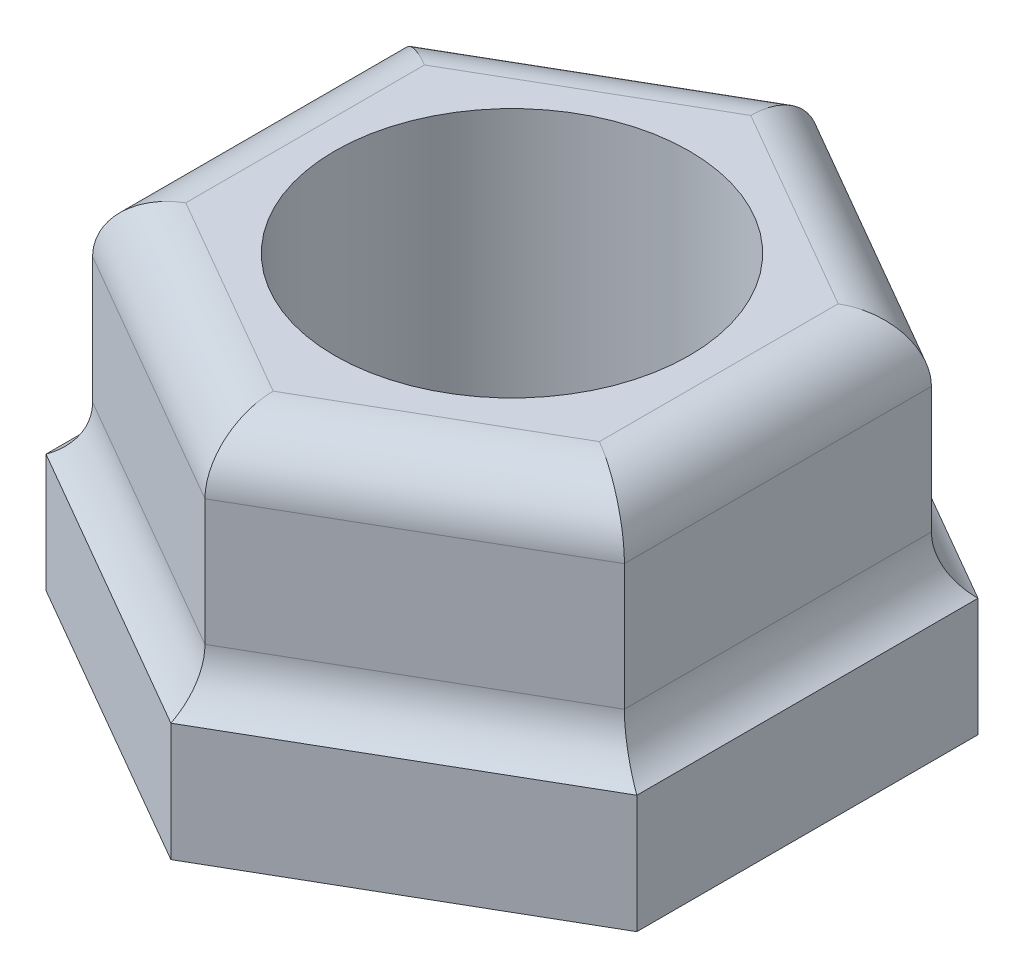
ISO-10303-21;
HEADER;
FILE_DESCRIPTION(('STEP AP214'),'2;1');
FILE_NAME('part.step','',(''),(''),'','','');
FILE_SCHEMA(('AUTOMOTIVE_DESIGN { 1 0 10303 214 1 1 1 1 }'));
ENDSEC;
DATA;
#1=APPLICATION_CONTEXT('core data for automotive mechanical design processes');
#2=APPLICATION_PROTOCOL_DEFINITION('international standard','automotive_design',2000,#1);
#3=PRODUCT_CONTEXT('',#1,'mechanical');
#4=PRODUCT('Part','Part','',(#3));
#5=PRODUCT_RELATED_PRODUCT_CATEGORY('part','',(#4));
#6=PRODUCT_DEFINITION_FORMATION('','',#4);
#7=PRODUCT_DEFINITION_CONTEXT('part definition',#1,'design');
#8=PRODUCT_DEFINITION('design','',#6,#7);
#9=PRODUCT_DEFINITION_SHAPE('','',#8);
#10=(LENGTH_UNIT() NAMED_UNIT(*) SI_UNIT(.MILLI.,.METRE.));
#11=(NAMED_UNIT(*) PLANE_ANGLE_UNIT() SI_UNIT($,.RADIAN.));
#12=(NAMED_UNIT(*) SI_UNIT($,.STERADIAN.) SOLID_ANGLE_UNIT());
#13=UNCERTAINTY_MEASURE_WITH_UNIT(LENGTH_MEASURE(1.E-05),#10,'distance_accuracy_value','');
#14=(GEOMETRIC_REPRESENTATION_CONTEXT(3) GLOBAL_UNCERTAINTY_ASSIGNED_CONTEXT((#13)) GLOBAL_UNIT_ASSIGNED_CONTEXT((#10,
#11,#12)) REPRESENTATION_CONTEXT('',''));
#15=CARTESIAN_POINT('',(0.,0.,0.));
#16=DIRECTION('',(0.,0.,1.));
#17=DIRECTION('',(1.,0.,0.));
#18=AXIS2_PLACEMENT_3D('',#15,#16,#17);
#19=CARTESIAN_POINT('',(0.,3.,0.));
#20=DIRECTION('',(0.,1.,0.));
#21=DIRECTION('',(0.,0.,1.));
#22=AXIS2_PLACEMENT_3D('',#19,#20,#21);
#23=PLANE('',#22);
#24=DIRECTION('',(0.,0.,-1.));
#25=VECTOR('',#24,1.);
#26=CARTESIAN_POINT('',(1.75,3.,0.));
#27=LINE('',#26,#25);
#28=CARTESIAN_POINT('',(1.75,3.,1.01036297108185));
#29=VERTEX_POINT('',#28);
#30=CARTESIAN_POINT('',(1.75,3.,-1.01036297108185));
#31=VERTEX_POINT('',#30);
#32=EDGE_CURVE('E243',#29,#31,#27,.T.);
#33=ORIENTED_EDGE('',*,*,#32,.T.);
#34=DIRECTION('',(-0.866025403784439,0.,-0.5));
#35=VECTOR('',#34,1.);
#36=CARTESIAN_POINT('',(0.875,3.,-1.51554445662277));
#37=LINE('',#36,#35);
#38=CARTESIAN_POINT('',(0.,3.,-2.02072594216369));
#39=VERTEX_POINT('',#38);
#40=EDGE_CURVE('E11',#31,#39,#37,.T.);
#41=ORIENTED_EDGE('',*,*,#40,.T.);
#42=DIRECTION('',(-0.866025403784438,0.,0.5));
#43=VECTOR('',#42,1.);
#44=CARTESIAN_POINT('',(-0.875000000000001,3.,-1.51554445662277));
#45=LINE('',#44,#43);
#46=CARTESIAN_POINT('',(-1.75,3.,-1.01036297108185));
#47=VERTEX_POINT('',#46);
#48=EDGE_CURVE('E57',#39,#47,#45,.T.);
#49=ORIENTED_EDGE('',*,*,#48,.T.);
#50=DIRECTION('',(0.,0.,1.));
#51=VECTOR('',#50,1.);
#52=CARTESIAN_POINT('',(-1.75,3.,0.));
#53=LINE('',#52,#51);
#54=CARTESIAN_POINT('',(-1.75,3.,1.01036297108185));
#55=VERTEX_POINT('',#54);
#56=EDGE_CURVE('E252',#47,#55,#53,.T.);
#57=ORIENTED_EDGE('',*,*,#56,.T.);
#58=DIRECTION('',(0.866025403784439,0.,0.5));
#59=VECTOR('',#58,1.);
#60=CARTESIAN_POINT('',(-0.875,3.,1.51554445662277));
#61=LINE('',#60,#59);
#62=CARTESIAN_POINT('',(0.,3.,2.02072594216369));
#63=VERTEX_POINT('',#62);
#64=EDGE_CURVE('E249',#55,#63,#61,.T.);
#65=ORIENTED_EDGE('',*,*,#64,.T.);
#66=DIRECTION('',(0.866025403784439,0.,-0.5));
#67=VECTOR('',#66,1.);
#68=CARTESIAN_POINT('',(0.875,3.,1.51554445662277));
#69=LINE('',#68,#67);
#70=EDGE_CURVE('E246',#63,#29,#69,.T.);
#71=ORIENTED_EDGE('',*,*,#70,.T.);
#72=EDGE_LOOP('',(#33,#41,#49,#57,#65,#71));
#73=FACE_BOUND('',#72,.T.);
#74=CARTESIAN_POINT('',(0.,3.,0.));
#75=DIRECTION('',(0.,1.,0.));
#76=DIRECTION('',(0.,0.,1.));
#77=AXIS2_PLACEMENT_3D('',#74,#75,#76);
#78=CIRCLE('',#77,1.5);
#79=CARTESIAN_POINT('',(0.,3.,1.5));
#80=VERTEX_POINT('',#79);
#81=EDGE_CURVE('E343',#80,#80,#78,.T.);
#82=ORIENTED_EDGE('',*,*,#81,.F.);
#83=EDGE_LOOP('',(#82));
#84=FACE_BOUND('',#83,.T.);
#85=ADVANCED_FACE('F47',(#73,#84),#23,.T.);
#86=CARTESIAN_POINT('',(-2.5,3.,1.44337567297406));
#87=DIRECTION('',(0.5,0.,-0.866025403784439));
#88=DIRECTION('',(-0.866025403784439,0.,-0.5));
#89=AXIS2_PLACEMENT_3D('',#86,#87,#88);
#90=PLANE('',#89);
#91=DIRECTION('',(0.866025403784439,0.,0.5));
#92=VECTOR('',#91,1.);
#93=CARTESIAN_POINT('',(-2.5,1.,1.44337567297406));
#94=LINE('',#93,#92);
#95=CARTESIAN_POINT('',(-2.5,1.,1.44337567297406));
#96=VERTEX_POINT('',#95);
#97=CARTESIAN_POINT('',(0.,1.,2.88675134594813));
#98=VERTEX_POINT('',#97);
#99=EDGE_CURVE('E157',#96,#98,#94,.T.);
#100=ORIENTED_EDGE('',*,*,#99,.F.);
#101=DIRECTION('',(0.,-1.,0.));
#102=VECTOR('',#101,1.);
#103=CARTESIAN_POINT('',(-2.5,3.,1.44337567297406));
#104=LINE('',#103,#102);
#105=CARTESIAN_POINT('',(-2.5,0.,1.44337567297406));
#106=VERTEX_POINT('',#105);
#107=EDGE_CURVE('E161',#96,#106,#104,.T.);
#108=ORIENTED_EDGE('',*,*,#107,.T.);
#109=DIRECTION('',(0.866025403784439,0.,0.5));
#110=VECTOR('',#109,1.);
#111=CARTESIAN_POINT('',(-2.5,0.,1.44337567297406));
#112=LINE('',#111,#110);
#113=CARTESIAN_POINT('',(0.,0.,2.88675134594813));
#114=VERTEX_POINT('',#113);
#115=EDGE_CURVE('E347',#106,#114,#112,.T.);
#116=ORIENTED_EDGE('',*,*,#115,.T.);
#117=DIRECTION('',(0.,-1.,0.));
#118=VECTOR('',#117,1.);
#119=CARTESIAN_POINT('',(0.,3.,2.88675134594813));
#120=LINE('',#119,#118);
#121=EDGE_CURVE('E163',#98,#114,#120,.T.);
#122=ORIENTED_EDGE('',*,*,#121,.F.);
#123=EDGE_LOOP('',(#100,#108,#116,#122));
#124=FACE_BOUND('',#123,.T.);
#125=ADVANCED_FACE('F159',(#124),#90,.F.);
#126=CARTESIAN_POINT('',(0.,3.,2.88675134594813));
#127=DIRECTION('',(-0.5,0.,-0.866025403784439));
#128=DIRECTION('',(-0.866025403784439,0.,0.5));
#129=AXIS2_PLACEMENT_3D('',#126,#127,#128);
#130=PLANE('',#129);
#131=DIRECTION('',(0.866025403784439,0.,-0.5));
#132=VECTOR('',#131,1.);
#133=CARTESIAN_POINT('',(0.,1.,2.88675134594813));
#134=LINE('',#133,#132);
#135=CARTESIAN_POINT('',(2.5,1.,1.44337567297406));
#136=VERTEX_POINT('',#135);
#137=EDGE_CURVE('E170',#98,#136,#134,.T.);
#138=ORIENTED_EDGE('',*,*,#137,.F.);
#139=ORIENTED_EDGE('',*,*,#121,.T.);
#140=DIRECTION('',(0.866025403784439,0.,-0.5));
#141=VECTOR('',#140,1.);
#142=CARTESIAN_POINT('',(0.,0.,2.88675134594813));
#143=LINE('',#142,#141);
#144=CARTESIAN_POINT('',(2.5,0.,1.44337567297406));
#145=VERTEX_POINT('',#144);
#146=EDGE_CURVE('E353',#114,#145,#143,.T.);
#147=ORIENTED_EDGE('',*,*,#146,.T.);
#148=DIRECTION('',(0.,-1.,0.));
#149=VECTOR('',#148,1.);
#150=CARTESIAN_POINT('',(2.5,3.,1.44337567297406));
#151=LINE('',#150,#149);
#152=EDGE_CURVE('E207',#136,#145,#151,.T.);
#153=ORIENTED_EDGE('',*,*,#152,.F.);
#154=EDGE_LOOP('',(#138,#139,#147,#153));
#155=FACE_BOUND('',#154,.T.);
#156=ADVANCED_FACE('F387',(#155),#130,.F.);
#157=CARTESIAN_POINT('',(2.5,3.,1.44337567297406));
#158=DIRECTION('',(-1.,0.,0.));
#159=DIRECTION('',(0.,0.,1.));
#160=AXIS2_PLACEMENT_3D('',#157,#158,#159);
#161=PLANE('',#160);
#162=DIRECTION('',(0.,0.,-1.));
#163=VECTOR('',#162,1.);
#164=CARTESIAN_POINT('',(2.5,1.,1.44337567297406));
#165=LINE('',#164,#163);
#166=CARTESIAN_POINT('',(2.5,1.,-1.44337567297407));
#167=VERTEX_POINT('',#166);
#168=EDGE_CURVE('E336',#136,#167,#165,.T.);
#169=ORIENTED_EDGE('',*,*,#168,.F.);
#170=ORIENTED_EDGE('',*,*,#152,.T.);
#171=DIRECTION('',(0.,0.,-1.));
#172=VECTOR('',#171,1.);
#173=CARTESIAN_POINT('',(2.5,0.,1.44337567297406));
#174=LINE('',#173,#172);
#175=CARTESIAN_POINT('',(2.5,0.,-1.44337567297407));
#176=VERTEX_POINT('',#175);
#177=EDGE_CURVE('E357',#145,#176,#174,.T.);
#178=ORIENTED_EDGE('',*,*,#177,.T.);
#179=DIRECTION('',(0.,-1.,0.));
#180=VECTOR('',#179,1.);
#181=CARTESIAN_POINT('',(2.5,3.,-1.44337567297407));
#182=LINE('',#181,#180);
#183=EDGE_CURVE('E376',#167,#176,#182,.T.);
#184=ORIENTED_EDGE('',*,*,#183,.F.);
#185=EDGE_LOOP('',(#169,#170,#178,#184));
#186=FACE_BOUND('',#185,.T.);
#187=ADVANCED_FACE('F381',(#186),#161,.F.);
#188=CARTESIAN_POINT('',(2.5,3.,-1.44337567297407));
#189=DIRECTION('',(-0.5,0.,0.866025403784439));
#190=DIRECTION('',(0.866025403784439,0.,0.5));
#191=AXIS2_PLACEMENT_3D('',#188,#189,#190);
#192=PLANE('',#191);
#193=DIRECTION('',(-0.866025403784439,0.,-0.5));
#194=VECTOR('',#193,1.);
#195=CARTESIAN_POINT('',(2.5,1.,-1.44337567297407));
#196=LINE('',#195,#194);
#197=CARTESIAN_POINT('',(0.,1.,-2.88675134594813));
#198=VERTEX_POINT('',#197);
#199=EDGE_CURVE('E332',#167,#198,#196,.T.);
#200=ORIENTED_EDGE('',*,*,#199,.F.);
#201=ORIENTED_EDGE('',*,*,#183,.T.);
#202=DIRECTION('',(-0.866025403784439,0.,-0.5));
#203=VECTOR('',#202,1.);
#204=CARTESIAN_POINT('',(2.5,0.,-1.44337567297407));
#205=LINE('',#204,#203);
#206=CARTESIAN_POINT('',(0.,0.,-2.88675134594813));
#207=VERTEX_POINT('',#206);
#208=EDGE_CURVE('E361',#176,#207,#205,.T.);
#209=ORIENTED_EDGE('',*,*,#208,.T.);
#210=DIRECTION('',(0.,-1.,0.));
#211=VECTOR('',#210,1.);
#212=CARTESIAN_POINT('',(0.,3.,-2.88675134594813));
#213=LINE('',#212,#211);
#214=EDGE_CURVE('E373',#198,#207,#213,.T.);
#215=ORIENTED_EDGE('',*,*,#214,.F.);
#216=EDGE_LOOP('',(#200,#201,#209,#215));
#217=FACE_BOUND('',#216,.T.);
#218=ADVANCED_FACE('F395',(#217),#192,.F.);
#219=CARTESIAN_POINT('',(0.,3.,-2.88675134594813));
#220=DIRECTION('',(0.5,0.,0.866025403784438));
#221=DIRECTION('',(0.866025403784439,0.,-0.5));
#222=AXIS2_PLACEMENT_3D('',#219,#220,#221);
#223=PLANE('',#222);
#224=DIRECTION('',(-0.866025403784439,0.,0.5));
#225=VECTOR('',#224,1.);
#226=CARTESIAN_POINT('',(0.,1.,-2.88675134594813));
#227=LINE('',#226,#225);
#228=CARTESIAN_POINT('',(-2.5,1.,-1.44337567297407));
#229=VERTEX_POINT('',#228);
#230=EDGE_CURVE('E329',#198,#229,#227,.T.);
#231=ORIENTED_EDGE('',*,*,#230,.F.);
#232=ORIENTED_EDGE('',*,*,#214,.T.);
#233=DIRECTION('',(-0.866025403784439,0.,0.5));
#234=VECTOR('',#233,1.);
#235=CARTESIAN_POINT('',(0.,0.,-2.88675134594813));
#236=LINE('',#235,#234);
#237=CARTESIAN_POINT('',(-2.5,0.,-1.44337567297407));
#238=VERTEX_POINT('',#237);
#239=EDGE_CURVE('E365',#207,#238,#236,.T.);
#240=ORIENTED_EDGE('',*,*,#239,.T.);
#241=DIRECTION('',(0.,-1.,0.));
#242=VECTOR('',#241,1.);
#243=CARTESIAN_POINT('',(-2.5,3.,-1.44337567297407));
#244=LINE('',#243,#242);
#245=EDGE_CURVE('E181',#229,#238,#244,.T.);
#246=ORIENTED_EDGE('',*,*,#245,.F.);
#247=EDGE_LOOP('',(#231,#232,#240,#246));
#248=FACE_BOUND('',#247,.T.);
#249=ADVANCED_FACE('F457',(#248),#223,.F.);
#250=CARTESIAN_POINT('',(-2.5,3.,-1.44337567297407));
#251=DIRECTION('',(1.,0.,0.));
#252=DIRECTION('',(0.,0.,-1.));
#253=AXIS2_PLACEMENT_3D('',#250,#251,#252);
#254=PLANE('',#253);
#255=DIRECTION('',(0.,0.,1.));
#256=VECTOR('',#255,1.);
#257=CARTESIAN_POINT('',(-2.5,1.,-1.44337567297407));
#258=LINE('',#257,#256);
#259=EDGE_CURVE('E175',#229,#96,#258,.T.);
#260=ORIENTED_EDGE('',*,*,#259,.F.);
#261=ORIENTED_EDGE('',*,*,#245,.T.);
#262=DIRECTION('',(0.,0.,1.));
#263=VECTOR('',#262,1.);
#264=CARTESIAN_POINT('',(-2.5,0.,-1.44337567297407));
#265=LINE('',#264,#263);
#266=EDGE_CURVE('E178',#238,#106,#265,.T.);
#267=ORIENTED_EDGE('',*,*,#266,.T.);
#268=ORIENTED_EDGE('',*,*,#107,.F.);
#269=EDGE_LOOP('',(#260,#261,#267,#268));
#270=FACE_BOUND('',#269,.T.);
#271=ADVANCED_FACE('F173',(#270),#254,.F.);
#272=CARTESIAN_POINT('',(0.,0.,0.));
#273=DIRECTION('',(0.,1.,0.));
#274=DIRECTION('',(0.,0.,1.));
#275=AXIS2_PLACEMENT_3D('',#272,#273,#274);
#276=PLANE('',#275);
#277=ORIENTED_EDGE('',*,*,#115,.F.);
#278=ORIENTED_EDGE('',*,*,#266,.F.);
#279=ORIENTED_EDGE('',*,*,#239,.F.);
#280=ORIENTED_EDGE('',*,*,#208,.F.);
#281=ORIENTED_EDGE('',*,*,#177,.F.);
#282=ORIENTED_EDGE('',*,*,#146,.F.);
#283=EDGE_LOOP('',(#277,#278,#279,#280,#281,#282));
#284=FACE_BOUND('',#283,.T.);
#285=CARTESIAN_POINT('',(0.,0.,0.));
#286=DIRECTION('',(0.,1.,0.));
#287=DIRECTION('',(0.,0.,1.));
#288=AXIS2_PLACEMENT_3D('',#285,#286,#287);
#289=CIRCLE('',#288,1.5);
#290=CARTESIAN_POINT('',(0.,0.,1.5));
#291=VERTEX_POINT('',#290);
#292=EDGE_CURVE('E169',#291,#291,#289,.T.);
#293=ORIENTED_EDGE('',*,*,#292,.T.);
#294=EDGE_LOOP('',(#293));
#295=FACE_BOUND('',#294,.T.);
#296=ADVANCED_FACE('F389',(#284,#295),#276,.F.);
#297=CARTESIAN_POINT('',(0.,3.,0.));
#298=DIRECTION('',(0.,-1.,0.));
#299=DIRECTION('',(0.,0.,-1.));
#300=AXIS2_PLACEMENT_3D('',#297,#298,#299);
#301=CYLINDRICAL_SURFACE('',#300,1.5);
#302=ORIENTED_EDGE('',*,*,#81,.T.);
#303=EDGE_LOOP('',(#302));
#304=FACE_BOUND('',#303,.T.);
#305=ORIENTED_EDGE('',*,*,#292,.F.);
#306=EDGE_LOOP('',(#305));
#307=FACE_BOUND('',#306,.T.);
#308=ADVANCED_FACE('F442',(#304,#307),#301,.F.);
#309=CARTESIAN_POINT('',(2.25,1.,1.29903810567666));
#310=DIRECTION('',(1.,0.,0.));
#311=DIRECTION('',(0.,0.,-1.));
#312=AXIS2_PLACEMENT_3D('',#309,#310,#311);
#313=PLANE('',#312);
#314=DIRECTION('',(0.,1.,0.));
#315=VECTOR('',#314,1.);
#316=CARTESIAN_POINT('',(2.25,1.,1.29903810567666));
#317=LINE('',#316,#315);
#318=CARTESIAN_POINT('',(2.25,1.43301270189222,1.29903810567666));
#319=VERTEX_POINT('',#318);
#320=CARTESIAN_POINT('',(2.25,2.5,1.29903810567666));
#321=VERTEX_POINT('',#320);
#322=EDGE_CURVE('E317',#319,#321,#317,.T.);
#323=ORIENTED_EDGE('',*,*,#322,.F.);
#324=DIRECTION('',(0.,0.,-1.));
#325=VECTOR('',#324,1.);
#326=CARTESIAN_POINT('',(2.25,1.43301270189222,-1.29903810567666));
#327=LINE('',#326,#325);
#328=CARTESIAN_POINT('',(2.25,1.43301270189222,-1.29903810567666));
#329=VERTEX_POINT('',#328);
#330=EDGE_CURVE('E240',#319,#329,#327,.T.);
#331=ORIENTED_EDGE('',*,*,#330,.T.);
#332=DIRECTION('',(0.,1.,0.));
#333=VECTOR('',#332,1.);
#334=CARTESIAN_POINT('',(2.25,1.,-1.29903810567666));
#335=LINE('',#334,#333);
#336=CARTESIAN_POINT('',(2.25,2.5,-1.29903810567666));
#337=VERTEX_POINT('',#336);
#338=EDGE_CURVE('E270',#329,#337,#335,.T.);
#339=ORIENTED_EDGE('',*,*,#338,.T.);
#340=DIRECTION('',(0.,0.,-1.));
#341=VECTOR('',#340,1.);
#342=CARTESIAN_POINT('',(2.25,2.5,1.29903810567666));
#343=LINE('',#342,#341);
#344=EDGE_CURVE('E237',#337,#321,#343,.F.);
#345=ORIENTED_EDGE('',*,*,#344,.T.);
#346=EDGE_LOOP('',(#323,#331,#339,#345));
#347=FACE_BOUND('',#346,.T.);
#348=ADVANCED_FACE('F424',(#347),#313,.T.);
#349=CARTESIAN_POINT('',(0.,1.,2.59807621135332));
#350=DIRECTION('',(0.5,0.,0.866025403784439));
#351=DIRECTION('',(0.866025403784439,0.,-0.5));
#352=AXIS2_PLACEMENT_3D('',#349,#350,#351);
#353=PLANE('',#352);
#354=DIRECTION('',(0.,1.,0.));
#355=VECTOR('',#354,1.);
#356=CARTESIAN_POINT('',(0.,1.,2.59807621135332));
#357=LINE('',#356,#355);
#358=CARTESIAN_POINT('',(0.,1.43301270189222,2.59807621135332));
#359=VERTEX_POINT('',#358);
#360=CARTESIAN_POINT('',(0.,2.5,2.59807621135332));
#361=VERTEX_POINT('',#360);
#362=EDGE_CURVE('E307',#359,#361,#357,.T.);
#363=ORIENTED_EDGE('',*,*,#362,.F.);
#364=DIRECTION('',(0.866025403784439,0.,-0.5));
#365=VECTOR('',#364,1.);
#366=CARTESIAN_POINT('',(2.25,1.43301270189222,1.29903810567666));
#367=LINE('',#366,#365);
#368=EDGE_CURVE('E234',#359,#319,#367,.T.);
#369=ORIENTED_EDGE('',*,*,#368,.T.);
#370=ORIENTED_EDGE('',*,*,#322,.T.);
#371=DIRECTION('',(0.866025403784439,0.,-0.5));
#372=VECTOR('',#371,1.);
#373=CARTESIAN_POINT('',(0.,2.5,2.59807621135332));
#374=LINE('',#373,#372);
#375=EDGE_CURVE('E231',#321,#361,#374,.F.);
#376=ORIENTED_EDGE('',*,*,#375,.T.);
#377=EDGE_LOOP('',(#363,#369,#370,#376));
#378=FACE_BOUND('',#377,.T.);
#379=ADVANCED_FACE('F433',(#378),#353,.T.);
#380=CARTESIAN_POINT('',(-2.25,1.,1.29903810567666));
#381=DIRECTION('',(-0.5,0.,0.866025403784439));
#382=DIRECTION('',(0.866025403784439,0.,0.5));
#383=AXIS2_PLACEMENT_3D('',#380,#381,#382);
#384=PLANE('',#383);
#385=DIRECTION('',(0.,1.,0.));
#386=VECTOR('',#385,1.);
#387=CARTESIAN_POINT('',(-2.25,1.,1.29903810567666));
#388=LINE('',#387,#386);
#389=CARTESIAN_POINT('',(-2.25,1.43301270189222,1.29903810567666));
#390=VERTEX_POINT('',#389);
#391=CARTESIAN_POINT('',(-2.25,2.5,1.29903810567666));
#392=VERTEX_POINT('',#391);
#393=EDGE_CURVE('E305',#390,#392,#388,.T.);
#394=ORIENTED_EDGE('',*,*,#393,.F.);
#395=DIRECTION('',(0.866025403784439,0.,0.5));
#396=VECTOR('',#395,1.);
#397=CARTESIAN_POINT('',(0.,1.43301270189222,2.59807621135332));
#398=LINE('',#397,#396);
#399=EDGE_CURVE('E187',#390,#359,#398,.T.);
#400=ORIENTED_EDGE('',*,*,#399,.T.);
#401=ORIENTED_EDGE('',*,*,#362,.T.);
#402=DIRECTION('',(0.866025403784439,0.,0.5));
#403=VECTOR('',#402,1.);
#404=CARTESIAN_POINT('',(-2.25,2.5,1.29903810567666));
#405=LINE('',#404,#403);
#406=EDGE_CURVE('E226',#361,#392,#405,.F.);
#407=ORIENTED_EDGE('',*,*,#406,.T.);
#408=EDGE_LOOP('',(#394,#400,#401,#407));
#409=FACE_BOUND('',#408,.T.);
#410=ADVANCED_FACE('F304',(#409),#384,.T.);
#411=CARTESIAN_POINT('',(-2.25,1.,-1.29903810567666));
#412=DIRECTION('',(-1.,0.,0.));
#413=DIRECTION('',(0.,0.,1.));
#414=AXIS2_PLACEMENT_3D('',#411,#412,#413);
#415=PLANE('',#414);
#416=DIRECTION('',(0.,1.,0.));
#417=VECTOR('',#416,1.);
#418=CARTESIAN_POINT('',(-2.25,1.,-1.29903810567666));
#419=LINE('',#418,#417);
#420=CARTESIAN_POINT('',(-2.25,1.43301270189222,-1.29903810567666));
#421=VERTEX_POINT('',#420);
#422=CARTESIAN_POINT('',(-2.25,2.5,-1.29903810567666));
#423=VERTEX_POINT('',#422);
#424=EDGE_CURVE('E313',#421,#423,#419,.T.);
#425=ORIENTED_EDGE('',*,*,#424,.F.);
#426=DIRECTION('',(0.,0.,1.));
#427=VECTOR('',#426,1.);
#428=CARTESIAN_POINT('',(-2.25,1.43301270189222,1.29903810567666));
#429=LINE('',#428,#427);
#430=EDGE_CURVE('E223',#421,#390,#429,.T.);
#431=ORIENTED_EDGE('',*,*,#430,.T.);
#432=ORIENTED_EDGE('',*,*,#393,.T.);
#433=DIRECTION('',(0.,0.,1.));
#434=VECTOR('',#433,1.);
#435=CARTESIAN_POINT('',(-2.25,2.5,-1.29903810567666));
#436=LINE('',#435,#434);
#437=EDGE_CURVE('E220',#392,#423,#436,.F.);
#438=ORIENTED_EDGE('',*,*,#437,.T.);
#439=EDGE_LOOP('',(#425,#431,#432,#438));
#440=FACE_BOUND('',#439,.T.);
#441=ADVANCED_FACE('F310',(#440),#415,.T.);
#442=CARTESIAN_POINT('',(0.,1.,-2.59807621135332));
#443=DIRECTION('',(-0.5,0.,-0.866025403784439));
#444=DIRECTION('',(-0.866025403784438,0.,0.5));
#445=AXIS2_PLACEMENT_3D('',#442,#443,#444);
#446=PLANE('',#445);
#447=DIRECTION('',(0.,1.,0.));
#448=VECTOR('',#447,1.);
#449=CARTESIAN_POINT('',(0.,1.,-2.59807621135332));
#450=LINE('',#449,#448);
#451=CARTESIAN_POINT('',(0.,1.43301270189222,-2.59807621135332));
#452=VERTEX_POINT('',#451);
#453=CARTESIAN_POINT('',(0.,2.5,-2.59807621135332));
#454=VERTEX_POINT('',#453);
#455=EDGE_CURVE('E319',#452,#454,#450,.T.);
#456=ORIENTED_EDGE('',*,*,#455,.F.);
#457=DIRECTION('',(-0.866025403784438,0.,0.5));
#458=VECTOR('',#457,1.);
#459=CARTESIAN_POINT('',(-2.25,1.43301270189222,-1.29903810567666));
#460=LINE('',#459,#458);
#461=EDGE_CURVE('E217',#452,#421,#460,.T.);
#462=ORIENTED_EDGE('',*,*,#461,.T.);
#463=ORIENTED_EDGE('',*,*,#424,.T.);
#464=DIRECTION('',(-0.866025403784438,0.,0.5));
#465=VECTOR('',#464,1.);
#466=CARTESIAN_POINT('',(0.,2.5,-2.59807621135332));
#467=LINE('',#466,#465);
#468=EDGE_CURVE('E214',#423,#454,#467,.F.);
#469=ORIENTED_EDGE('',*,*,#468,.T.);
#470=EDGE_LOOP('',(#456,#462,#463,#469));
#471=FACE_BOUND('',#470,.T.);
#472=ADVANCED_FACE('F409',(#471),#446,.T.);
#473=CARTESIAN_POINT('',(2.25,1.,-1.29903810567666));
#474=DIRECTION('',(0.5,0.,-0.866025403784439));
#475=DIRECTION('',(-0.866025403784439,0.,-0.5));
#476=AXIS2_PLACEMENT_3D('',#473,#474,#475);
#477=PLANE('',#476);
#478=ORIENTED_EDGE('',*,*,#338,.F.);
#479=DIRECTION('',(-0.866025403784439,0.,-0.5));
#480=VECTOR('',#479,1.);
#481=CARTESIAN_POINT('',(0.,1.43301270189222,-2.59807621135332));
#482=LINE('',#481,#480);
#483=EDGE_CURVE('E205',#329,#452,#482,.T.);
#484=ORIENTED_EDGE('',*,*,#483,.T.);
#485=ORIENTED_EDGE('',*,*,#455,.T.);
#486=DIRECTION('',(-0.866025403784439,0.,-0.5));
#487=VECTOR('',#486,1.);
#488=CARTESIAN_POINT('',(2.25,2.5,-1.29903810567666));
#489=LINE('',#488,#487);
#490=EDGE_CURVE('E200',#454,#337,#489,.F.);
#491=ORIENTED_EDGE('',*,*,#490,.T.);
#492=EDGE_LOOP('',(#478,#484,#485,#491));
#493=FACE_BOUND('',#492,.T.);
#494=ADVANCED_FACE('F408',(#493),#477,.T.);
#495=CARTESIAN_POINT('',(-1.375,1.43301270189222,2.38156986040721));
#496=DIRECTION('',(-0.866025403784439,0.,-0.5));
#497=DIRECTION('',(-0.5,0.,0.866025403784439));
#498=AXIS2_PLACEMENT_3D('',#495,#496,#497);
#499=CYLINDRICAL_SURFACE('',#498,0.5);
#500=CARTESIAN_POINT('',(-2.75,1.43301270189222,1.58771324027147));
#501=DIRECTION('',(-0.5,0.,-0.866025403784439));
#502=DIRECTION('',(0.866025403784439,0.,-0.5));
#503=AXIS2_PLACEMENT_3D('',#500,#501,#502);
#504=ELLIPSE('',#503,0.577350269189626,0.5);
#505=EDGE_CURVE('E185',#96,#390,#504,.F.);
#506=ORIENTED_EDGE('',*,*,#505,.F.);
#507=ORIENTED_EDGE('',*,*,#99,.T.);
#508=CARTESIAN_POINT('',(0.,1.43301270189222,3.17542648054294));
#509=DIRECTION('',(-1.,0.,0.));
#510=DIRECTION('',(0.,0.,1.));
#511=AXIS2_PLACEMENT_3D('',#508,#509,#510);
#512=ELLIPSE('',#511,0.577350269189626,0.5);
#513=EDGE_CURVE('E191',#359,#98,#512,.T.);
#514=ORIENTED_EDGE('',*,*,#513,.F.);
#515=ORIENTED_EDGE('',*,*,#399,.F.);
#516=EDGE_LOOP('',(#506,#507,#514,#515));
#517=FACE_BOUND('',#516,.T.);
#518=ADVANCED_FACE('F186',(#517),#499,.F.);
#519=CARTESIAN_POINT('',(1.375,1.43301270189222,2.38156986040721));
#520=DIRECTION('',(-0.866025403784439,0.,0.5));
#521=DIRECTION('',(0.5,0.,0.866025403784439));
#522=AXIS2_PLACEMENT_3D('',#519,#520,#521);
#523=CYLINDRICAL_SURFACE('',#522,0.5);
#524=ORIENTED_EDGE('',*,*,#513,.T.);
#525=ORIENTED_EDGE('',*,*,#137,.T.);
#526=CARTESIAN_POINT('',(2.75,1.43301270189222,1.58771324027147));
#527=DIRECTION('',(-0.5,0.,0.866025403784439));
#528=DIRECTION('',(-0.866025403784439,0.,-0.5));
#529=AXIS2_PLACEMENT_3D('',#526,#527,#528);
#530=ELLIPSE('',#529,0.577350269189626,0.5);
#531=EDGE_CURVE('E192',#319,#136,#530,.T.);
#532=ORIENTED_EDGE('',*,*,#531,.F.);
#533=ORIENTED_EDGE('',*,*,#368,.F.);
#534=EDGE_LOOP('',(#524,#525,#532,#533));
#535=FACE_BOUND('',#534,.T.);
#536=ADVANCED_FACE('F431',(#535),#523,.F.);
#537=CARTESIAN_POINT('',(-2.75,1.43301270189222,0.));
#538=DIRECTION('',(0.,0.,-1.));
#539=DIRECTION('',(-1.,0.,0.));
#540=AXIS2_PLACEMENT_3D('',#537,#538,#539);
#541=CYLINDRICAL_SURFACE('',#540,0.5);
#542=ORIENTED_EDGE('',*,*,#505,.T.);
#543=ORIENTED_EDGE('',*,*,#430,.F.);
#544=CARTESIAN_POINT('',(-2.75,1.43301270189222,-1.58771324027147));
#545=DIRECTION('',(0.5,0.,-0.866025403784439));
#546=DIRECTION('',(-0.866025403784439,0.,-0.5));
#547=AXIS2_PLACEMENT_3D('',#544,#545,#546);
#548=ELLIPSE('',#547,0.577350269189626,0.5);
#549=EDGE_CURVE('E197',#229,#421,#548,.F.);
#550=ORIENTED_EDGE('',*,*,#549,.F.);
#551=ORIENTED_EDGE('',*,*,#259,.T.);
#552=EDGE_LOOP('',(#542,#543,#550,#551));
#553=FACE_BOUND('',#552,.T.);
#554=ADVANCED_FACE('F195',(#553),#541,.F.);
#555=CARTESIAN_POINT('',(2.75,1.43301270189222,0.));
#556=DIRECTION('',(0.,0.,1.));
#557=DIRECTION('',(1.,0.,0.));
#558=AXIS2_PLACEMENT_3D('',#555,#556,#557);
#559=CYLINDRICAL_SURFACE('',#558,0.5);
#560=ORIENTED_EDGE('',*,*,#531,.T.);
#561=ORIENTED_EDGE('',*,*,#168,.T.);
#562=CARTESIAN_POINT('',(2.75,1.43301270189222,-1.58771324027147));
#563=DIRECTION('',(0.5,0.,0.866025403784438));
#564=DIRECTION('',(-0.866025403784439,0.,0.5));
#565=AXIS2_PLACEMENT_3D('',#562,#563,#564);
#566=ELLIPSE('',#565,0.577350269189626,0.5);
#567=EDGE_CURVE('E260',#329,#167,#566,.T.);
#568=ORIENTED_EDGE('',*,*,#567,.F.);
#569=ORIENTED_EDGE('',*,*,#330,.F.);
#570=EDGE_LOOP('',(#560,#561,#568,#569));
#571=FACE_BOUND('',#570,.T.);
#572=ADVANCED_FACE('F428',(#571),#559,.F.);
#573=CARTESIAN_POINT('',(-1.375,1.43301270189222,-2.38156986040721));
#574=DIRECTION('',(0.866025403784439,0.,-0.5));
#575=DIRECTION('',(-0.5,0.,-0.866025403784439));
#576=AXIS2_PLACEMENT_3D('',#573,#574,#575);
#577=CYLINDRICAL_SURFACE('',#576,0.5);
#578=ORIENTED_EDGE('',*,*,#549,.T.);
#579=ORIENTED_EDGE('',*,*,#461,.F.);
#580=CARTESIAN_POINT('',(0.,1.43301270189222,-3.17542648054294));
#581=DIRECTION('',(1.,0.,0.));
#582=DIRECTION('',(0.,0.,1.));
#583=AXIS2_PLACEMENT_3D('',#580,#581,#582);
#584=ELLIPSE('',#583,0.577350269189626,0.5);
#585=EDGE_CURVE('E257',#198,#452,#584,.F.);
#586=ORIENTED_EDGE('',*,*,#585,.F.);
#587=ORIENTED_EDGE('',*,*,#230,.T.);
#588=EDGE_LOOP('',(#578,#579,#586,#587));
#589=FACE_BOUND('',#588,.T.);
#590=ADVANCED_FACE('F403',(#589),#577,.F.);
#591=CARTESIAN_POINT('',(1.375,1.43301270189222,-2.38156986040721));
#592=DIRECTION('',(0.866025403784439,0.,0.5));
#593=DIRECTION('',(0.5,0.,-0.866025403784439));
#594=AXIS2_PLACEMENT_3D('',#591,#592,#593);
#595=CYLINDRICAL_SURFACE('',#594,0.5);
#596=ORIENTED_EDGE('',*,*,#567,.T.);
#597=ORIENTED_EDGE('',*,*,#199,.T.);
#598=ORIENTED_EDGE('',*,*,#585,.T.);
#599=ORIENTED_EDGE('',*,*,#483,.F.);
#600=EDGE_LOOP('',(#596,#597,#598,#599));
#601=FACE_BOUND('',#600,.T.);
#602=ADVANCED_FACE('F398',(#601),#595,.F.);
#603=CARTESIAN_POINT('',(-0.875,2.5,1.51554445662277));
#604=DIRECTION('',(0.866025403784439,0.,0.5));
#605=DIRECTION('',(0.5,0.,-0.866025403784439));
#606=AXIS2_PLACEMENT_3D('',#603,#604,#605);
#607=CYLINDRICAL_SURFACE('',#606,0.5);
#608=CARTESIAN_POINT('',(-1.75,2.5,1.01036297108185));
#609=DIRECTION('',(0.5,0.,0.866025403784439));
#610=DIRECTION('',(0.866025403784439,0.,-0.5));
#611=AXIS2_PLACEMENT_3D('',#608,#609,#610);
#612=ELLIPSE('',#611,0.577350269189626,0.5);
#613=EDGE_CURVE('E283',#392,#55,#612,.F.);
#614=ORIENTED_EDGE('',*,*,#613,.F.);
#615=ORIENTED_EDGE('',*,*,#406,.F.);
#616=CARTESIAN_POINT('',(0.,2.5,2.02072594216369));
#617=DIRECTION('',(1.,0.,0.));
#618=DIRECTION('',(0.,0.,-1.));
#619=AXIS2_PLACEMENT_3D('',#616,#617,#618);
#620=ELLIPSE('',#619,0.577350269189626,0.5);
#621=EDGE_CURVE('E51',#63,#361,#620,.T.);
#622=ORIENTED_EDGE('',*,*,#621,.F.);
#623=ORIENTED_EDGE('',*,*,#64,.F.);
#624=EDGE_LOOP('',(#614,#615,#622,#623));
#625=FACE_BOUND('',#624,.T.);
#626=ADVANCED_FACE('F49',(#625),#607,.T.);
#627=CARTESIAN_POINT('',(0.875,2.5,1.51554445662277));
#628=DIRECTION('',(0.866025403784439,0.,-0.5));
#629=DIRECTION('',(-0.5,0.,-0.866025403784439));
#630=AXIS2_PLACEMENT_3D('',#627,#628,#629);
#631=CYLINDRICAL_SURFACE('',#630,0.5);
#632=ORIENTED_EDGE('',*,*,#621,.T.);
#633=ORIENTED_EDGE('',*,*,#375,.F.);
#634=CARTESIAN_POINT('',(1.75,2.5,1.01036297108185));
#635=DIRECTION('',(0.5,0.,-0.866025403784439));
#636=DIRECTION('',(-0.866025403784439,0.,-0.5));
#637=AXIS2_PLACEMENT_3D('',#634,#635,#636);
#638=ELLIPSE('',#637,0.577350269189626,0.5);
#639=EDGE_CURVE('E280',#29,#321,#638,.T.);
#640=ORIENTED_EDGE('',*,*,#639,.F.);
#641=ORIENTED_EDGE('',*,*,#70,.F.);
#642=EDGE_LOOP('',(#632,#633,#640,#641));
#643=FACE_BOUND('',#642,.T.);
#644=ADVANCED_FACE('F295',(#643),#631,.T.);
#645=CARTESIAN_POINT('',(-1.75,2.5,0.));
#646=DIRECTION('',(0.,0.,1.));
#647=DIRECTION('',(1.,0.,0.));
#648=AXIS2_PLACEMENT_3D('',#645,#646,#647);
#649=CYLINDRICAL_SURFACE('',#648,0.5);
#650=ORIENTED_EDGE('',*,*,#613,.T.);
#651=ORIENTED_EDGE('',*,*,#56,.F.);
#652=CARTESIAN_POINT('',(-1.75,2.5,-1.01036297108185));
#653=DIRECTION('',(-0.5,0.,0.866025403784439));
#654=DIRECTION('',(0.866025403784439,0.,0.5));
#655=AXIS2_PLACEMENT_3D('',#652,#653,#654);
#656=ELLIPSE('',#655,0.577350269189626,0.5);
#657=EDGE_CURVE('E276',#423,#47,#656,.F.);
#658=ORIENTED_EDGE('',*,*,#657,.F.);
#659=ORIENTED_EDGE('',*,*,#437,.F.);
#660=EDGE_LOOP('',(#650,#651,#658,#659));
#661=FACE_BOUND('',#660,.T.);
#662=ADVANCED_FACE('F485',(#661),#649,.T.);
#663=CARTESIAN_POINT('',(1.75,2.5,0.));
#664=DIRECTION('',(0.,0.,-1.));
#665=DIRECTION('',(-1.,0.,0.));
#666=AXIS2_PLACEMENT_3D('',#663,#664,#665);
#667=CYLINDRICAL_SURFACE('',#666,0.5);
#668=ORIENTED_EDGE('',*,*,#639,.T.);
#669=ORIENTED_EDGE('',*,*,#344,.F.);
#670=CARTESIAN_POINT('',(1.75,2.5,-1.01036297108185));
#671=DIRECTION('',(-0.5,0.,-0.866025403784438));
#672=DIRECTION('',(0.866025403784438,0.,-0.5));
#673=AXIS2_PLACEMENT_3D('',#670,#671,#672);
#674=ELLIPSE('',#673,0.577350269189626,0.5);
#675=EDGE_CURVE('E273',#31,#337,#674,.T.);
#676=ORIENTED_EDGE('',*,*,#675,.F.);
#677=ORIENTED_EDGE('',*,*,#32,.F.);
#678=EDGE_LOOP('',(#668,#669,#676,#677));
#679=FACE_BOUND('',#678,.T.);
#680=ADVANCED_FACE('F420',(#679),#667,.T.);
#681=CARTESIAN_POINT('',(-0.875000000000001,2.5,-1.51554445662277));
#682=DIRECTION('',(-0.866025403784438,0.,0.5));
#683=DIRECTION('',(0.5,0.,0.866025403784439));
#684=AXIS2_PLACEMENT_3D('',#681,#682,#683);
#685=CYLINDRICAL_SURFACE('',#684,0.5);
#686=ORIENTED_EDGE('',*,*,#657,.T.);
#687=ORIENTED_EDGE('',*,*,#48,.F.);
#688=CARTESIAN_POINT('',(0.,2.5,-2.02072594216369));
#689=DIRECTION('',(-1.,0.,0.));
#690=DIRECTION('',(0.,0.,1.));
#691=AXIS2_PLACEMENT_3D('',#688,#689,#690);
#692=ELLIPSE('',#691,0.577350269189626,0.5);
#693=EDGE_CURVE('E65',#454,#39,#692,.F.);
#694=ORIENTED_EDGE('',*,*,#693,.F.);
#695=ORIENTED_EDGE('',*,*,#468,.F.);
#696=EDGE_LOOP('',(#686,#687,#694,#695));
#697=FACE_BOUND('',#696,.T.);
#698=ADVANCED_FACE('F413',(#697),#685,.T.);
#699=CARTESIAN_POINT('',(0.875,2.5,-1.51554445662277));
#700=DIRECTION('',(-0.866025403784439,0.,-0.5));
#701=DIRECTION('',(-0.5,0.,0.866025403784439));
#702=AXIS2_PLACEMENT_3D('',#699,#700,#701);
#703=CYLINDRICAL_SURFACE('',#702,0.5);
#704=ORIENTED_EDGE('',*,*,#675,.T.);
#705=ORIENTED_EDGE('',*,*,#490,.F.);
#706=ORIENTED_EDGE('',*,*,#693,.T.);
#707=ORIENTED_EDGE('',*,*,#40,.F.);
#708=EDGE_LOOP('',(#704,#705,#706,#707));
#709=FACE_BOUND('',#708,.T.);
#710=ADVANCED_FACE('F417',(#709),#703,.T.);
#711=CLOSED_SHELL('',(#85,#125,#156,#187,#218,#249,#271,#296,#308,#348,#379,#410,#441,#472,#494,
#518,#536,#554,#572,#590,#602,#626,#644,#662,#680,#698,#710));
#712=MANIFOLD_SOLID_BREP('B2',#711);
#713=ADVANCED_BREP_SHAPE_REPRESENTATION('',(#18,#712),#14);
#714=SHAPE_DEFINITION_REPRESENTATION(#9,#713);
ENDSEC;
END-ISO-10303-21;
